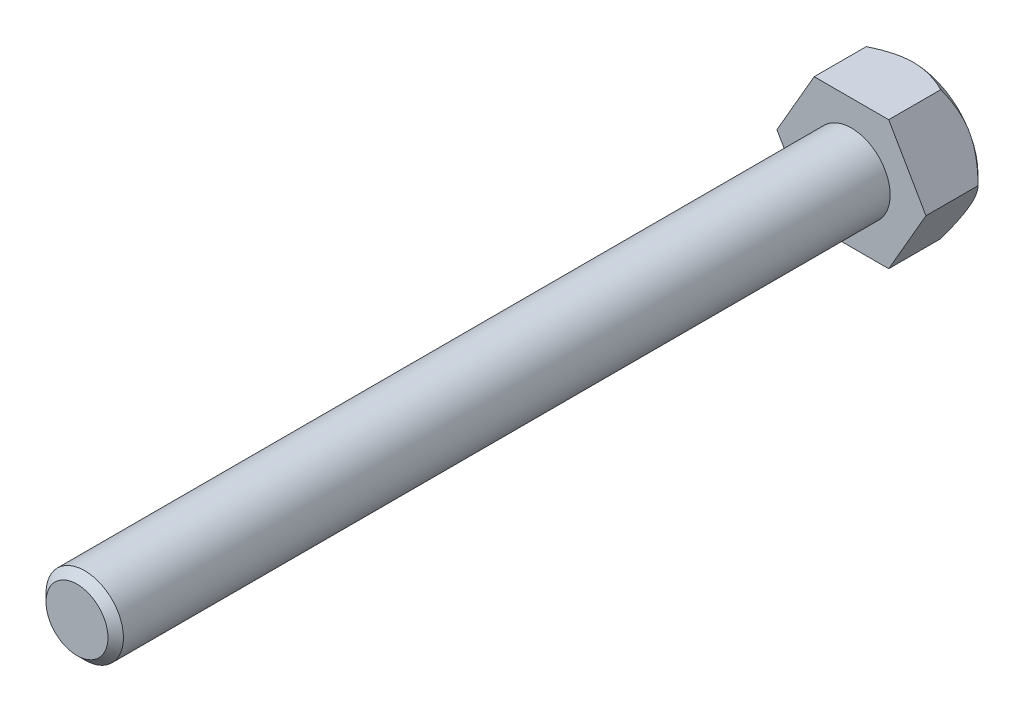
from build123d import *

# Parameters (mm, degrees)
EXTRUSION1_DEPTH = 4.8
ESQUISSE2_R      = 3
EXTRUSION2_DEPTH = 60
CHANFREIN1_SIZE  = 0.6


with BuildPart() as part:
    # Esquisse1 → Extrusion1 (new body)
    with BuildSketch(Plane.XY):
        Polygon((5.773502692, 0), (2.886751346, 5), (-2.886751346, 5), (-5.773502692, 0), (-2.886751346, -5), (2.886751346, -5), align=None)
    extrude(amount=EXTRUSION1_DEPTH)

    # Esquisse2 → Extrusion2 (add)
    with BuildSketch(Plane.XY.offset(4.8)):
        Circle(ESQUISSE2_R)
    extrude(amount=EXTRUSION2_DEPTH)

    # Esquisse3 → Enl_vement de mati_re-R_volution1 (revolve, cut)
    with BuildSketch(Plane(origin=(0, 0, 0), x_dir=(1, 0, 0), z_dir=(0, 1, 0))):
        Polygon((5.773502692, 0), (5.004271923, 0), (5.773502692, -0.769230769), align=None)
    revolve(axis=Axis((0, 0, 0), (0, 0, 1)), mode=Mode.SUBTRACT)

    # Chanfrein1
    chanfrein1_edges = [part.edges().sort_by_distance(p)[0] for p in [
        (-3, 0, 64.8),
    ]]
    chamfer(chanfrein1_edges, length=CHANFREIN1_SIZE)


solid = part.part
